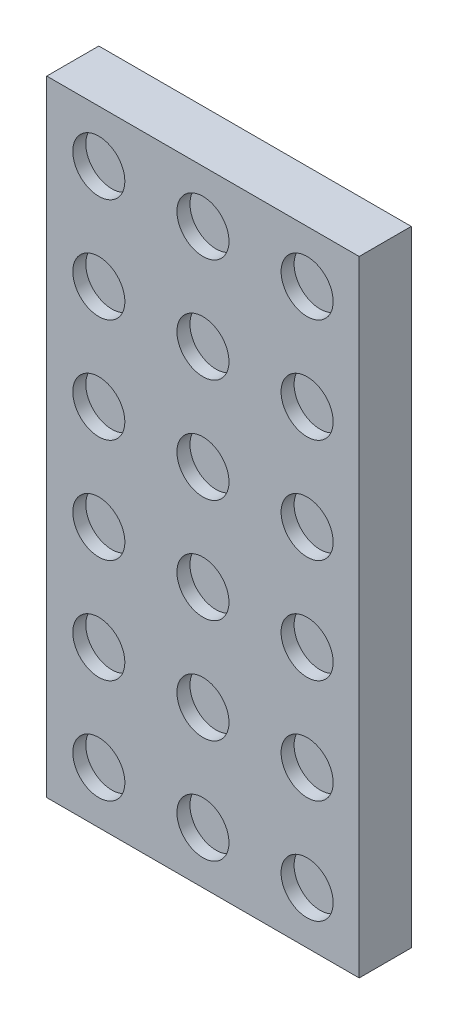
from build123d import *

# Parameters (mm, degrees)
SKETCH1_W           = 76.2
SKETCH1_H           = 152.4
BOSS_EXTRUDE1_DEPTH = 12.7
SKETCH3_R           = 6.35
CUT_EXTRUDE2_DEPTH  = 3.175
SKETCH5_R           = 31.75
CUT_EXTRUDE3_DEPTH  = 8.89
SKETCH6_W           = 2.54
SKETCH6_H           = 44.475410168
CUT_EXTRUDE4_DEPTH  = 8.89


with BuildPart() as part:
    # Sketch1 → Boss-Extrude1 (new body)
    with BuildSketch(Plane.XY):
        with Locations((38.1, 76.2)):
            Rectangle(SKETCH1_W, SKETCH1_H)
    extrude(amount=BOSS_EXTRUDE1_DEPTH)

    # Sketch3 → Cut-Extrude2 (cut)
    with BuildSketch(Plane.XY.offset(12.7)):
        with Locations((12.7, 139.7)):
            Circle(SKETCH3_R)
        with Locations((38.1, 139.7)):
            Circle(SKETCH3_R)
        with Locations((63.5, 139.7)):
            Circle(SKETCH3_R)
        with Locations((88.9, 139.7)):
            Circle(SKETCH3_R)
        with Locations((88.9, 114.3)):
            Circle(SKETCH3_R)
        with Locations(Location((63.5, 114.3, 0), (0, 0, 180))):
            Circle(SKETCH3_R)
        with Locations(Location((38.1, 114.3, 0), (0, 0, 180))):
            Circle(SKETCH3_R)
        with Locations(Location((12.7, 114.3, 0), (0, 0, 180))):
            Circle(SKETCH3_R)
        with Locations((88.9, 88.9)):
            Circle(SKETCH3_R)
        with Locations((63.5, 88.9)):
            Circle(SKETCH3_R)
        with Locations((38.1, 88.9)):
            Circle(SKETCH3_R)
        with Locations((12.7, 88.9)):
            Circle(SKETCH3_R)
        with Locations((88.9, 63.5)):
            Circle(SKETCH3_R)
        with Locations(Location((63.5, 63.5, 0), (0, 0, 180))):
            Circle(SKETCH3_R)
        with Locations(Location((38.1, 63.5, 0), (0, 0, 180))):
            Circle(SKETCH3_R)
        with Locations(Location((12.7, 63.5, 0), (0, 0, 180))):
            Circle(SKETCH3_R)
        with Locations((88.9, 38.1)):
            Circle(SKETCH3_R)
        with Locations((63.5, 38.1)):
            Circle(SKETCH3_R)
        with Locations((38.1, 38.1)):
            Circle(SKETCH3_R)
        with Locations((12.7, 38.1)):
            Circle(SKETCH3_R)
        with Locations((88.9, 12.7)):
            Circle(SKETCH3_R)
        with Locations(Location((63.5, 12.7, 0), (0, 0, 180))):
            Circle(SKETCH3_R)
        with Locations(Location((38.1, 12.7, 0), (0, 0, 180))):
            Circle(SKETCH3_R)
        with Locations(Location((12.7, 12.7, 0), (0, 0, 180))):
            Circle(SKETCH3_R)
    extrude(amount=-CUT_EXTRUDE2_DEPTH, mode=Mode.SUBTRACT)

    # Sketch5 → Cut-Extrude3 (cut)
    with BuildSketch(Plane(origin=(0, 0, 0), x_dir=(-1, 0, 0), z_dir=(0, 0, -1))):
        with Locations((-38.1, 76.2)):
            Circle(SKETCH5_R)
    extrude(amount=-CUT_EXTRUDE3_DEPTH, mode=Mode.SUBTRACT)

    # Sketch6 → Cut-Extrude4 (cut)
    with BuildSketch(Plane(origin=(0, 0, 0), x_dir=(-1, 0, 0), z_dir=(0, 0, -1))):
        with Locations((-38.1, 22.237705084)):
            Rectangle(SKETCH6_W, SKETCH6_H)
    extrude(amount=-CUT_EXTRUDE4_DEPTH, mode=Mode.SUBTRACT)


solid = part.part
